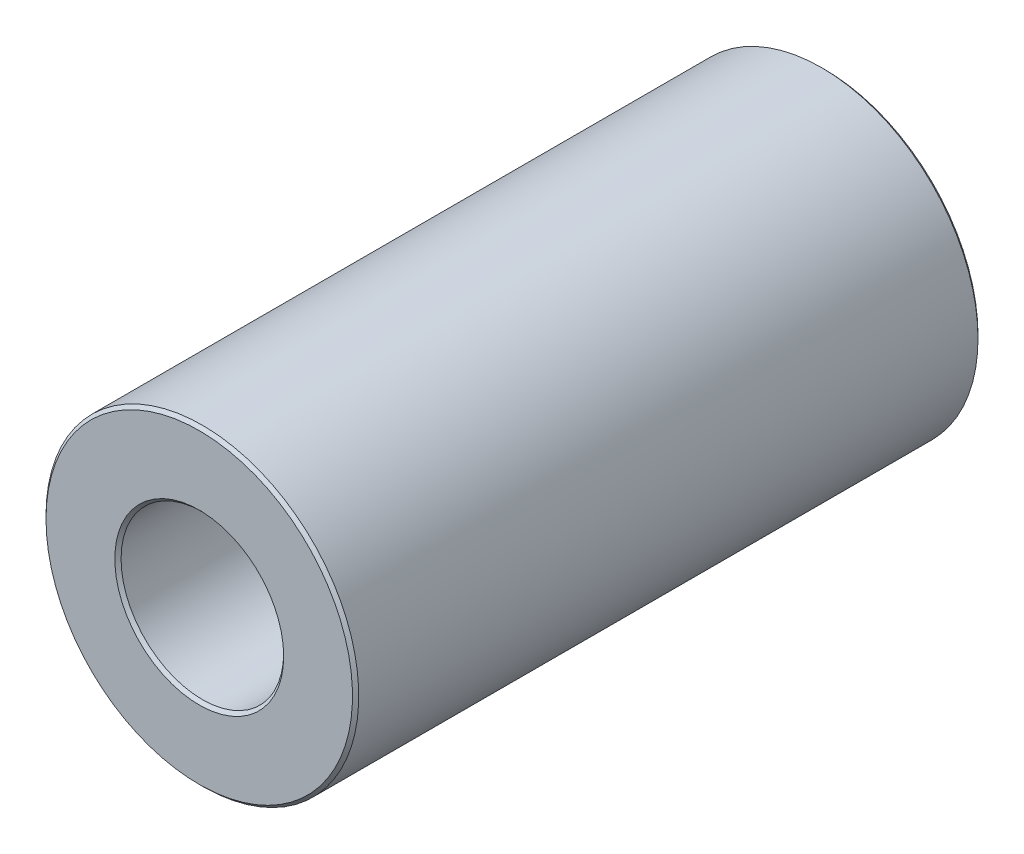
ISO-10303-21;
HEADER;
FILE_DESCRIPTION(('STEP AP214'),'2;1');
FILE_NAME('part.step','',(''),(''),'','','');
FILE_SCHEMA(('AUTOMOTIVE_DESIGN { 1 0 10303 214 1 1 1 1 }'));
ENDSEC;
DATA;
#1=APPLICATION_CONTEXT('core data for automotive mechanical design processes');
#2=APPLICATION_PROTOCOL_DEFINITION('international standard','automotive_design',2000,#1);
#3=PRODUCT_CONTEXT('',#1,'mechanical');
#4=PRODUCT('Part','Part','',(#3));
#5=PRODUCT_RELATED_PRODUCT_CATEGORY('part','',(#4));
#6=PRODUCT_DEFINITION_FORMATION('','',#4);
#7=PRODUCT_DEFINITION_CONTEXT('part definition',#1,'design');
#8=PRODUCT_DEFINITION('design','',#6,#7);
#9=PRODUCT_DEFINITION_SHAPE('','',#8);
#10=(LENGTH_UNIT() NAMED_UNIT(*) SI_UNIT(.MILLI.,.METRE.));
#11=(NAMED_UNIT(*) PLANE_ANGLE_UNIT() SI_UNIT($,.RADIAN.));
#12=(NAMED_UNIT(*) SI_UNIT($,.STERADIAN.) SOLID_ANGLE_UNIT());
#13=UNCERTAINTY_MEASURE_WITH_UNIT(LENGTH_MEASURE(1.E-05),#10,'distance_accuracy_value','');
#14=(GEOMETRIC_REPRESENTATION_CONTEXT(3) GLOBAL_UNCERTAINTY_ASSIGNED_CONTEXT((#13)) GLOBAL_UNIT_ASSIGNED_CONTEXT((#10,
#11,#12)) REPRESENTATION_CONTEXT('',''));
#15=CARTESIAN_POINT('',(0.,0.,0.));
#16=DIRECTION('',(0.,0.,1.));
#17=DIRECTION('',(1.,0.,0.));
#18=AXIS2_PLACEMENT_3D('',#15,#16,#17);
#19=CARTESIAN_POINT('',(0.,0.,10.));
#20=DIRECTION('',(0.,0.,1.));
#21=DIRECTION('',(1.,0.,0.));
#22=AXIS2_PLACEMENT_3D('',#19,#20,#21);
#23=PLANE('',#22);
#24=CARTESIAN_POINT('',(0.,0.,10.));
#25=DIRECTION('',(0.,0.,1.));
#26=DIRECTION('',(1.,0.,0.));
#27=AXIS2_PLACEMENT_3D('',#24,#25,#26);
#28=CIRCLE('',#27,2.70000000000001);
#29=CARTESIAN_POINT('',(2.70000000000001,0.,10.));
#30=VERTEX_POINT('',#29);
#31=EDGE_CURVE('E10',#30,#30,#28,.F.);
#32=ORIENTED_EDGE('',*,*,#31,.T.);
#33=EDGE_LOOP('',(#32));
#34=FACE_BOUND('',#33,.T.);
#35=CARTESIAN_POINT('',(0.,0.,10.));
#36=DIRECTION('',(0.,0.,1.));
#37=DIRECTION('',(1.,0.,0.));
#38=AXIS2_PLACEMENT_3D('',#35,#36,#37);
#39=CIRCLE('',#38,4.9);
#40=CARTESIAN_POINT('',(-4.90000000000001,0.,10.));
#41=VERTEX_POINT('',#40);
#42=EDGE_CURVE('E45',#41,#41,#39,.T.);
#43=ORIENTED_EDGE('',*,*,#42,.T.);
#44=EDGE_LOOP('',(#43));
#45=FACE_BOUND('',#44,.T.);
#46=ADVANCED_FACE('F37',(#34,#45),#23,.T.);
#47=CARTESIAN_POINT('',(0.,0.,-10.));
#48=DIRECTION('',(0.,0.,1.));
#49=DIRECTION('',(1.,0.,0.));
#50=AXIS2_PLACEMENT_3D('',#47,#48,#49);
#51=PLANE('',#50);
#52=CARTESIAN_POINT('',(0.,0.,-10.));
#53=DIRECTION('',(0.,0.,1.));
#54=DIRECTION('',(1.,0.,0.));
#55=AXIS2_PLACEMENT_3D('',#52,#53,#54);
#56=CIRCLE('',#55,4.9);
#57=CARTESIAN_POINT('',(4.9,0.,-10.));
#58=VERTEX_POINT('',#57);
#59=EDGE_CURVE('E62',#58,#58,#56,.F.);
#60=ORIENTED_EDGE('',*,*,#59,.T.);
#61=EDGE_LOOP('',(#60));
#62=FACE_BOUND('',#61,.T.);
#63=CARTESIAN_POINT('',(0.,0.,-10.));
#64=DIRECTION('',(0.,0.,1.));
#65=DIRECTION('',(1.,0.,0.));
#66=AXIS2_PLACEMENT_3D('',#63,#64,#65);
#67=CIRCLE('',#66,2.7);
#68=CARTESIAN_POINT('',(2.7,0.,-10.));
#69=VERTEX_POINT('',#68);
#70=EDGE_CURVE('E65',#69,#69,#67,.T.);
#71=ORIENTED_EDGE('',*,*,#70,.T.);
#72=EDGE_LOOP('',(#71));
#73=FACE_BOUND('',#72,.T.);
#74=ADVANCED_FACE('F89',(#62,#73),#51,.F.);
#75=CARTESIAN_POINT('',(0.,0.,10.));
#76=DIRECTION('',(0.,0.,-1.));
#77=DIRECTION('',(-1.,0.,0.));
#78=AXIS2_PLACEMENT_3D('',#75,#76,#77);
#79=CYLINDRICAL_SURFACE('',#78,5.);
#80=CARTESIAN_POINT('',(0.,0.,-9.9));
#81=DIRECTION('',(0.,0.,1.));
#82=DIRECTION('',(1.,0.,0.));
#83=AXIS2_PLACEMENT_3D('',#80,#81,#82);
#84=CIRCLE('',#83,5.);
#85=CARTESIAN_POINT('',(5.,0.,-9.9));
#86=VERTEX_POINT('',#85);
#87=EDGE_CURVE('E69',#86,#86,#84,.T.);
#88=ORIENTED_EDGE('',*,*,#87,.T.);
#89=EDGE_LOOP('',(#88));
#90=FACE_BOUND('',#89,.T.);
#91=CARTESIAN_POINT('',(0.,0.,9.90000000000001));
#92=DIRECTION('',(0.,0.,1.));
#93=DIRECTION('',(1.,0.,0.));
#94=AXIS2_PLACEMENT_3D('',#91,#92,#93);
#95=CIRCLE('',#94,5.);
#96=CARTESIAN_POINT('',(-5.,0.,9.9));
#97=VERTEX_POINT('',#96);
#98=EDGE_CURVE('E73',#97,#97,#95,.F.);
#99=ORIENTED_EDGE('',*,*,#98,.T.);
#100=EDGE_LOOP('',(#99));
#101=FACE_BOUND('',#100,.T.);
#102=ADVANCED_FACE('F78',(#90,#101),#79,.T.);
#103=CARTESIAN_POINT('',(0.,0.,10.));
#104=DIRECTION('',(0.,0.,-1.));
#105=DIRECTION('',(-1.,0.,0.));
#106=AXIS2_PLACEMENT_3D('',#103,#104,#105);
#107=CYLINDRICAL_SURFACE('',#106,2.6);
#108=CARTESIAN_POINT('',(0.,0.,-9.9));
#109=DIRECTION('',(0.,0.,1.));
#110=DIRECTION('',(1.,0.,0.));
#111=AXIS2_PLACEMENT_3D('',#108,#109,#110);
#112=CIRCLE('',#111,2.6);
#113=CARTESIAN_POINT('',(2.6,0.,-9.9));
#114=VERTEX_POINT('',#113);
#115=EDGE_CURVE('E51',#114,#114,#112,.F.);
#116=ORIENTED_EDGE('',*,*,#115,.T.);
#117=EDGE_LOOP('',(#116));
#118=FACE_BOUND('',#117,.T.);
#119=CARTESIAN_POINT('',(0.,0.,9.89999999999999));
#120=DIRECTION('',(0.,0.,1.));
#121=DIRECTION('',(1.,0.,0.));
#122=AXIS2_PLACEMENT_3D('',#119,#120,#121);
#123=CIRCLE('',#122,2.6);
#124=CARTESIAN_POINT('',(2.6,0.,9.89999999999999));
#125=VERTEX_POINT('',#124);
#126=EDGE_CURVE('E56',#125,#125,#123,.T.);
#127=ORIENTED_EDGE('',*,*,#126,.T.);
#128=EDGE_LOOP('',(#127));
#129=FACE_BOUND('',#128,.T.);
#130=ADVANCED_FACE('F97',(#118,#129),#107,.F.);
#131=CARTESIAN_POINT('',(0.,0.,-9.9));
#132=DIRECTION('',(0.,0.,1.));
#133=DIRECTION('',(1.,0.,0.));
#134=AXIS2_PLACEMENT_3D('',#131,#132,#133);
#135=CONICAL_SURFACE('',#134,5.,0.785398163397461);
#136=ORIENTED_EDGE('',*,*,#59,.F.);
#137=EDGE_LOOP('',(#136));
#138=FACE_BOUND('',#137,.T.);
#139=ORIENTED_EDGE('',*,*,#87,.F.);
#140=EDGE_LOOP('',(#139));
#141=FACE_BOUND('',#140,.T.);
#142=ADVANCED_FACE('F102',(#138,#141),#135,.T.);
#143=CARTESIAN_POINT('',(0.,0.,-10.));
#144=DIRECTION('',(0.,0.,-1.));
#145=DIRECTION('',(-1.,0.,0.));
#146=AXIS2_PLACEMENT_3D('',#143,#144,#145);
#147=CONICAL_SURFACE('',#146,2.7,0.785398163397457);
#148=ORIENTED_EDGE('',*,*,#115,.F.);
#149=EDGE_LOOP('',(#148));
#150=FACE_BOUND('',#149,.T.);
#151=ORIENTED_EDGE('',*,*,#70,.F.);
#152=EDGE_LOOP('',(#151));
#153=FACE_BOUND('',#152,.T.);
#154=ADVANCED_FACE('F86',(#150,#153),#147,.F.);
#155=CARTESIAN_POINT('',(0.,0.,9.89999999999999));
#156=DIRECTION('',(0.,0.,1.));
#157=DIRECTION('',(1.,0.,0.));
#158=AXIS2_PLACEMENT_3D('',#155,#156,#157);
#159=CONICAL_SURFACE('',#158,2.6,0.785398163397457);
#160=ORIENTED_EDGE('',*,*,#31,.F.);
#161=EDGE_LOOP('',(#160));
#162=FACE_BOUND('',#161,.T.);
#163=ORIENTED_EDGE('',*,*,#126,.F.);
#164=EDGE_LOOP('',(#163));
#165=FACE_BOUND('',#164,.T.);
#166=ADVANCED_FACE('F82',(#162,#165),#159,.F.);
#167=CARTESIAN_POINT('',(0.,0.,10.));
#168=DIRECTION('',(0.,0.,-1.));
#169=DIRECTION('',(-1.,0.,0.));
#170=AXIS2_PLACEMENT_3D('',#167,#168,#169);
#171=CONICAL_SURFACE('',#170,4.9,0.785398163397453);
#172=CARTESIAN_POINT('',(-5.,0.,9.9));
#173=CARTESIAN_POINT('',(-4.99895833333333,0.,9.90104166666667));
#174=CARTESIAN_POINT('',(-4.99791666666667,0.,9.90208333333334));
#175=CARTESIAN_POINT('',(-4.99583333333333,0.,9.90416666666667));
#176=CARTESIAN_POINT('',(-4.99479166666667,0.,9.90520833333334));
#177=CARTESIAN_POINT('',(-4.99270833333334,0.,9.90729166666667));
#178=CARTESIAN_POINT('',(-4.99166666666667,0.,9.90833333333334));
#179=CARTESIAN_POINT('',(-4.98958333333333,0.,9.91041666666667));
#180=CARTESIAN_POINT('',(-4.98854166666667,0.,9.91145833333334));
#181=CARTESIAN_POINT('',(-4.98645833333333,0.,9.91354166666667));
#182=CARTESIAN_POINT('',(-4.98541666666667,0.,9.91458333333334));
#183=CARTESIAN_POINT('',(-4.98333333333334,0.,9.91666666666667));
#184=CARTESIAN_POINT('',(-4.98229166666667,0.,9.91770833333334));
#185=CARTESIAN_POINT('',(-4.98020833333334,0.,9.91979166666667));
#186=CARTESIAN_POINT('',(-4.97916666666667,0.,9.92083333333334));
#187=CARTESIAN_POINT('',(-4.97708333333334,0.,9.92291666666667));
#188=CARTESIAN_POINT('',(-4.97604166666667,0.,9.92395833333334));
#189=CARTESIAN_POINT('',(-4.97395833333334,0.,9.92604166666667));
#190=CARTESIAN_POINT('',(-4.97291666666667,0.,9.92708333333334));
#191=CARTESIAN_POINT('',(-4.97083333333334,0.,9.92916666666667));
#192=CARTESIAN_POINT('',(-4.96979166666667,0.,9.93020833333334));
#193=CARTESIAN_POINT('',(-4.96770833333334,0.,9.93229166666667));
#194=CARTESIAN_POINT('',(-4.96666666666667,0.,9.93333333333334));
#195=CARTESIAN_POINT('',(-4.96458333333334,0.,9.93541666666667));
#196=CARTESIAN_POINT('',(-4.96354166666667,0.,9.93645833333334));
#197=CARTESIAN_POINT('',(-4.96145833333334,0.,9.93854166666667));
#198=CARTESIAN_POINT('',(-4.96041666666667,0.,9.93958333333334));
#199=CARTESIAN_POINT('',(-4.95833333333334,0.,9.94166666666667));
#200=CARTESIAN_POINT('',(-4.95729166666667,0.,9.94270833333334));
#201=CARTESIAN_POINT('',(-4.95520833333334,0.,9.94479166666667));
#202=CARTESIAN_POINT('',(-4.95416666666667,0.,9.94583333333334));
#203=CARTESIAN_POINT('',(-4.95208333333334,0.,9.94791666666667));
#204=CARTESIAN_POINT('',(-4.95104166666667,0.,9.94895833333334));
#205=CARTESIAN_POINT('',(-4.94895833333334,0.,9.95104166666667));
#206=CARTESIAN_POINT('',(-4.94791666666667,0.,9.95208333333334));
#207=CARTESIAN_POINT('',(-4.94583333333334,0.,9.95416666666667));
#208=CARTESIAN_POINT('',(-4.94479166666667,0.,9.95520833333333));
#209=CARTESIAN_POINT('',(-4.94270833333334,0.,9.95729166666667));
#210=CARTESIAN_POINT('',(-4.94166666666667,0.,9.95833333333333));
#211=CARTESIAN_POINT('',(-4.93958333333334,0.,9.96041666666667));
#212=CARTESIAN_POINT('',(-4.93854166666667,0.,9.96145833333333));
#213=CARTESIAN_POINT('',(-4.93645833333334,0.,9.96354166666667));
#214=CARTESIAN_POINT('',(-4.93541666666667,0.,9.96458333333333));
#215=CARTESIAN_POINT('',(-4.93333333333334,0.,9.96666666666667));
#216=CARTESIAN_POINT('',(-4.93229166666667,0.,9.96770833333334));
#217=CARTESIAN_POINT('',(-4.93020833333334,0.,9.96979166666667));
#218=CARTESIAN_POINT('',(-4.92916666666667,0.,9.97083333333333));
#219=CARTESIAN_POINT('',(-4.92708333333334,0.,9.97291666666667));
#220=CARTESIAN_POINT('',(-4.92604166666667,0.,9.97395833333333));
#221=CARTESIAN_POINT('',(-4.92395833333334,0.,9.97604166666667));
#222=CARTESIAN_POINT('',(-4.92291666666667,0.,9.97708333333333));
#223=CARTESIAN_POINT('',(-4.92083333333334,0.,9.97916666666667));
#224=CARTESIAN_POINT('',(-4.91979166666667,0.,9.98020833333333));
#225=CARTESIAN_POINT('',(-4.91770833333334,0.,9.98229166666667));
#226=CARTESIAN_POINT('',(-4.91666666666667,0.,9.98333333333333));
#227=CARTESIAN_POINT('',(-4.91458333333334,0.,9.98541666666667));
#228=CARTESIAN_POINT('',(-4.91354166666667,0.,9.98645833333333));
#229=CARTESIAN_POINT('',(-4.91145833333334,0.,9.98854166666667));
#230=CARTESIAN_POINT('',(-4.91041666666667,0.,9.98958333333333));
#231=CARTESIAN_POINT('',(-4.90833333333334,0.,9.99166666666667));
#232=CARTESIAN_POINT('',(-4.90729166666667,0.,9.99270833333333));
#233=CARTESIAN_POINT('',(-4.90520833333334,0.,9.99479166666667));
#234=CARTESIAN_POINT('',(-4.90416666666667,0.,9.99583333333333));
#235=CARTESIAN_POINT('',(-4.90208333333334,0.,9.99791666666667));
#236=CARTESIAN_POINT('',(-4.90104166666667,0.,9.99895833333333));
#237=CARTESIAN_POINT('',(-4.90000000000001,0.,10.));
#238=B_SPLINE_CURVE_WITH_KNOTS('',3,(#172,#173,#174,#175,#176,#177,#178,#179,#180,#181,#182,
#183,#184,#185,#186,#187,#188,#189,#190,#191,#192,#193,#194,#195,#196,#197,#198,#199,#200,#201,
#202,#203,#204,#205,#206,#207,#208,#209,#210,#211,#212,#213,#214,#215,#216,#217,#218,#219,#220,
#221,#222,#223,#224,#225,#226,#227,#228,#229,#230,#231,#232,#233,#234,#235,#236,#237),
.UNSPECIFIED.,.F.,.F.,(4,2,2,2,2,2,2,2,2,2,2,2,2,2,2,2,2,2,2,2,2,2,2,2,2,2,2,2,2,2,2,2,4),(0.,
0.00441941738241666,0.0088388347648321,0.0132582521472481,0.0176776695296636,0.022097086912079,
0.0265165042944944,0.0309359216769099,0.0353553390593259,0.0397747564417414,0.0441941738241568,
0.0486135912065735,0.0530330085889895,0.0574524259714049,0.0618718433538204,0.0662912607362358,
0.0707106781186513,0.0751300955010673,0.0795495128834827,0.0839689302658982,0.0883883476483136,
0.0928077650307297,0.0972271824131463,0.101646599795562,0.106066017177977,0.110485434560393,
0.114904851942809,0.119324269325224,0.12374368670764,0.128163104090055,0.132582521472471,
0.137001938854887,0.141421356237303),.UNSPECIFIED.);
#239=EDGE_CURVE('BSEAM39',#97,#41,#238,.T.);
#240=ORIENTED_EDGE('',*,*,#98,.F.);
#241=ORIENTED_EDGE('',*,*,#42,.F.);
#242=ORIENTED_EDGE('',*,*,#239,.T.);
#243=ORIENTED_EDGE('',*,*,#239,.F.);
#244=EDGE_LOOP('',(#240,#242,#241,#243));
#245=FACE_BOUND('',#244,.T.);
#246=ADVANCED_FACE('F39',(#245),#171,.T.);
#247=CLOSED_SHELL('',(#46,#74,#102,#130,#142,#154,#166,#246));
#248=MANIFOLD_SOLID_BREP('B2',#247);
#249=ADVANCED_BREP_SHAPE_REPRESENTATION('',(#18,#248),#14);
#250=SHAPE_DEFINITION_REPRESENTATION(#9,#249);
ENDSEC;
END-ISO-10303-21;
